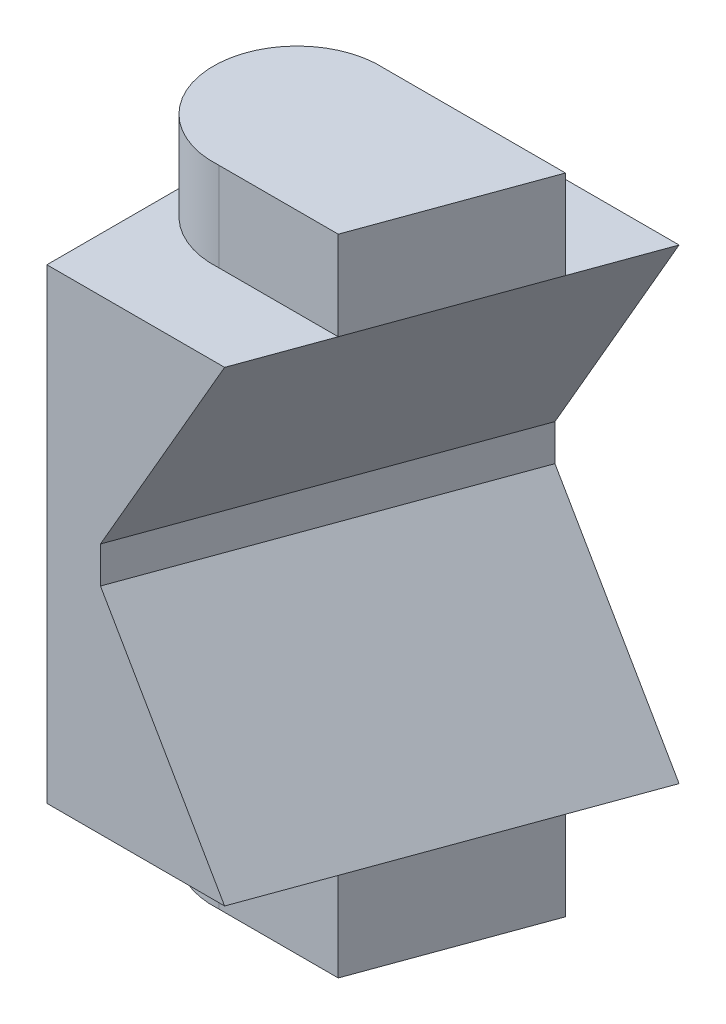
ISO-10303-21;
HEADER;
FILE_DESCRIPTION(('STEP AP214'),'2;1');
FILE_NAME('part.step','',(''),(''),'','','');
FILE_SCHEMA(('AUTOMOTIVE_DESIGN { 1 0 10303 214 1 1 1 1 }'));
ENDSEC;
DATA;
#1=APPLICATION_CONTEXT('core data for automotive mechanical design processes');
#2=APPLICATION_PROTOCOL_DEFINITION('international standard','automotive_design',2000,#1);
#3=PRODUCT_CONTEXT('',#1,'mechanical');
#4=PRODUCT('Part','Part','',(#3));
#5=PRODUCT_RELATED_PRODUCT_CATEGORY('part','',(#4));
#6=PRODUCT_DEFINITION_FORMATION('','',#4);
#7=PRODUCT_DEFINITION_CONTEXT('part definition',#1,'design');
#8=PRODUCT_DEFINITION('design','',#6,#7);
#9=PRODUCT_DEFINITION_SHAPE('','',#8);
#10=(LENGTH_UNIT() NAMED_UNIT(*) SI_UNIT(.MILLI.,.METRE.));
#11=(NAMED_UNIT(*) PLANE_ANGLE_UNIT() SI_UNIT($,.RADIAN.));
#12=(NAMED_UNIT(*) SI_UNIT($,.STERADIAN.) SOLID_ANGLE_UNIT());
#13=UNCERTAINTY_MEASURE_WITH_UNIT(LENGTH_MEASURE(1.E-05),#10,'distance_accuracy_value','');
#14=(GEOMETRIC_REPRESENTATION_CONTEXT(3) GLOBAL_UNCERTAINTY_ASSIGNED_CONTEXT((#13)) GLOBAL_UNIT_ASSIGNED_CONTEXT((#10,
#11,#12)) REPRESENTATION_CONTEXT('',''));
#15=CARTESIAN_POINT('',(0.,0.,0.));
#16=DIRECTION('',(0.,0.,1.));
#17=DIRECTION('',(1.,0.,0.));
#18=AXIS2_PLACEMENT_3D('',#15,#16,#17);
#19=CARTESIAN_POINT('',(0.,10.5,15.));
#20=DIRECTION('',(0.,-1.,0.));
#21=DIRECTION('',(0.,0.,1.));
#22=AXIS2_PLACEMENT_3D('',#19,#20,#21);
#23=PLANE('',#22);
#24=CARTESIAN_POINT('',(3.75781240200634,10.5,7.5));
#25=DIRECTION('',(0.,-1.,0.));
#26=DIRECTION('',(0.,0.,1.));
#27=AXIS2_PLACEMENT_3D('',#24,#25,#26);
#28=CIRCLE('',#27,3.7578125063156);
#29=CARTESIAN_POINT('',(-1.04309262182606E-07,10.5,7.5));
#30=VERTEX_POINT('',#29);
#31=CARTESIAN_POINT('',(4.,10.5,3.75));
#32=VERTEX_POINT('',#31);
#33=EDGE_CURVE('E9',#30,#32,#28,.T.);
#34=ORIENTED_EDGE('',*,*,#33,.T.);
#35=DIRECTION('',(1.,0.,0.));
#36=VECTOR('',#35,1.);
#37=CARTESIAN_POINT('',(4.,10.5,3.75));
#38=LINE('',#37,#36);
#39=CARTESIAN_POINT('',(12.0946651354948,10.5,3.75));
#40=VERTEX_POINT('',#39);
#41=EDGE_CURVE('E141',#32,#40,#38,.T.);
#42=ORIENTED_EDGE('',*,*,#41,.T.);
#43=DIRECTION('',(-0.342020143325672,0.,0.939692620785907));
#44=VECTOR('',#43,1.);
#45=CARTESIAN_POINT('',(13.4595535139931,10.5,0.));
#46=LINE('',#45,#44);
#47=CARTESIAN_POINT('',(13.4595535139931,10.5,0.));
#48=VERTEX_POINT('',#47);
#49=EDGE_CURVE('E204',#48,#40,#46,.T.);
#50=ORIENTED_EDGE('',*,*,#49,.F.);
#51=DIRECTION('',(-1.,0.,0.));
#52=VECTOR('',#51,1.);
#53=CARTESIAN_POINT('',(13.4595535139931,10.5,0.));
#54=LINE('',#53,#52);
#55=CARTESIAN_POINT('',(0.,10.5,0.));
#56=VERTEX_POINT('',#55);
#57=EDGE_CURVE('E208',#48,#56,#54,.T.);
#58=ORIENTED_EDGE('',*,*,#57,.T.);
#59=DIRECTION('',(0.,0.,-1.));
#60=VECTOR('',#59,1.);
#61=CARTESIAN_POINT('',(0.,10.5,15.));
#62=LINE('',#61,#60);
#63=EDGE_CURVE('E199',#30,#56,#62,.T.);
#64=ORIENTED_EDGE('',*,*,#63,.F.);
#65=EDGE_LOOP('',(#34,#42,#50,#58,#64));
#66=FACE_BOUND('',#65,.T.);
#67=ADVANCED_FACE('F14',(#66),#23,.F.);
#68=CARTESIAN_POINT('',(0.,-10.5,15.));
#69=DIRECTION('',(0.,-1.,0.));
#70=DIRECTION('',(0.,0.,1.));
#71=AXIS2_PLACEMENT_3D('',#68,#69,#70);
#72=PLANE('',#71);
#73=DIRECTION('',(-1.,0.,0.));
#74=VECTOR('',#73,1.);
#75=CARTESIAN_POINT('',(4.,-10.5,11.25));
#76=LINE('',#75,#74);
#77=CARTESIAN_POINT('',(9.36488837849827,-10.5,11.25));
#78=VERTEX_POINT('',#77);
#79=CARTESIAN_POINT('',(4.,-10.5,11.25));
#80=VERTEX_POINT('',#79);
#81=EDGE_CURVE('E159',#78,#80,#76,.T.);
#82=ORIENTED_EDGE('',*,*,#81,.F.);
#83=DIRECTION('',(-0.342020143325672,0.,0.939692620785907));
#84=VECTOR('',#83,1.);
#85=CARTESIAN_POINT('',(13.4595535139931,-10.5,0.));
#86=LINE('',#85,#84);
#87=CARTESIAN_POINT('',(8.,-10.5,15.));
#88=VERTEX_POINT('',#87);
#89=EDGE_CURVE('E219',#78,#88,#86,.T.);
#90=ORIENTED_EDGE('',*,*,#89,.T.);
#91=DIRECTION('',(1.,0.,0.));
#92=VECTOR('',#91,1.);
#93=CARTESIAN_POINT('',(0.,-10.5,15.));
#94=LINE('',#93,#92);
#95=CARTESIAN_POINT('',(0.,-10.5,15.));
#96=VERTEX_POINT('',#95);
#97=EDGE_CURVE('E214',#96,#88,#94,.T.);
#98=ORIENTED_EDGE('',*,*,#97,.F.);
#99=DIRECTION('',(0.,0.,-1.));
#100=VECTOR('',#99,1.);
#101=CARTESIAN_POINT('',(0.,-10.5,15.));
#102=LINE('',#101,#100);
#103=CARTESIAN_POINT('',(0.,-10.5,7.5));
#104=VERTEX_POINT('',#103);
#105=EDGE_CURVE('E224',#96,#104,#102,.T.);
#106=ORIENTED_EDGE('',*,*,#105,.T.);
#107=CARTESIAN_POINT('',(3.75781240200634,-10.5,7.5));
#108=DIRECTION('',(0.,-1.,0.));
#109=DIRECTION('',(0.,0.,1.));
#110=AXIS2_PLACEMENT_3D('',#107,#108,#109);
#111=CIRCLE('',#110,3.7578125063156);
#112=EDGE_CURVE('E39',#80,#104,#111,.T.);
#113=ORIENTED_EDGE('',*,*,#112,.F.);
#114=EDGE_LOOP('',(#82,#90,#98,#106,#113));
#115=FACE_BOUND('',#114,.T.);
#116=ADVANCED_FACE('F272',(#115),#72,.T.);
#117=DIRECTION('',(-1.,0.,0.));
#118=VECTOR('',#117,1.);
#119=CARTESIAN_POINT('',(4.,10.5,11.25));
#120=LINE('',#119,#118);
#121=CARTESIAN_POINT('',(9.36488837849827,10.5,11.25));
#122=VERTEX_POINT('',#121);
#123=CARTESIAN_POINT('',(4.,10.5,11.25));
#124=VERTEX_POINT('',#123);
#125=EDGE_CURVE('E150',#122,#124,#120,.T.);
#126=ORIENTED_EDGE('',*,*,#125,.T.);
#127=EDGE_CURVE('E25',#124,#30,#28,.T.);
#128=ORIENTED_EDGE('',*,*,#127,.T.);
#129=CARTESIAN_POINT('',(0.,10.5,15.));
#130=VERTEX_POINT('',#129);
#131=EDGE_CURVE('E211',#130,#30,#62,.T.);
#132=ORIENTED_EDGE('',*,*,#131,.F.);
#133=DIRECTION('',(1.,0.,0.));
#134=VECTOR('',#133,1.);
#135=CARTESIAN_POINT('',(0.,10.5,15.));
#136=LINE('',#135,#134);
#137=CARTESIAN_POINT('',(8.,10.5,15.));
#138=VERTEX_POINT('',#137);
#139=EDGE_CURVE('E200',#130,#138,#136,.T.);
#140=ORIENTED_EDGE('',*,*,#139,.T.);
#141=EDGE_CURVE('E207',#122,#138,#46,.T.);
#142=ORIENTED_EDGE('',*,*,#141,.F.);
#143=EDGE_LOOP('',(#126,#128,#132,#140,#142));
#144=FACE_BOUND('',#143,.T.);
#145=ADVANCED_FACE('F254',(#144),#23,.F.);
#146=CARTESIAN_POINT('',(0.,-10.5,15.));
#147=DIRECTION('',(1.,0.,0.));
#148=DIRECTION('',(0.,0.,1.));
#149=AXIS2_PLACEMENT_3D('',#146,#147,#148);
#150=PLANE('',#149);
#151=DIRECTION('',(0.,1.,0.));
#152=VECTOR('',#151,1.);
#153=CARTESIAN_POINT('',(0.,-10.5,0.));
#154=LINE('',#153,#152);
#155=CARTESIAN_POINT('',(0.,-10.5,0.));
#156=VERTEX_POINT('',#155);
#157=EDGE_CURVE('E227',#156,#56,#154,.T.);
#158=ORIENTED_EDGE('',*,*,#157,.F.);
#159=EDGE_CURVE('E203',#104,#156,#102,.T.);
#160=ORIENTED_EDGE('',*,*,#159,.F.);
#161=ORIENTED_EDGE('',*,*,#105,.F.);
#162=DIRECTION('',(0.,1.,0.));
#163=VECTOR('',#162,1.);
#164=CARTESIAN_POINT('',(0.,-10.5,15.));
#165=LINE('',#164,#163);
#166=EDGE_CURVE('E217',#96,#130,#165,.T.);
#167=ORIENTED_EDGE('',*,*,#166,.T.);
#168=ORIENTED_EDGE('',*,*,#131,.T.);
#169=ORIENTED_EDGE('',*,*,#63,.T.);
#170=EDGE_LOOP('',(#158,#160,#161,#167,#168,#169));
#171=FACE_BOUND('',#170,.T.);
#172=ADVANCED_FACE('F259',(#171),#150,.F.);
#173=CARTESIAN_POINT('',(13.4595535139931,-10.5,0.));
#174=DIRECTION('',(0.,0.,-1.));
#175=DIRECTION('',(1.,0.,0.));
#176=AXIS2_PLACEMENT_3D('',#173,#174,#175);
#177=PLANE('',#176);
#178=DIRECTION('',(-0.5,-0.866025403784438,0.));
#179=VECTOR('',#178,1.);
#180=CARTESIAN_POINT('',(15.8017737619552,14.5568444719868,0.));
#181=LINE('',#180,#179);
#182=CARTESIAN_POINT('',(7.87080290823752,0.82,0.));
#183=VERTEX_POINT('',#182);
#184=EDGE_CURVE('E182',#48,#183,#181,.T.);
#185=ORIENTED_EDGE('',*,*,#184,.T.);
#186=DIRECTION('',(0.,-1.,0.));
#187=VECTOR('',#186,1.);
#188=CARTESIAN_POINT('',(7.87080290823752,0.82,0.));
#189=LINE('',#188,#187);
#190=CARTESIAN_POINT('',(7.87080290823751,-0.82,0.));
#191=VERTEX_POINT('',#190);
#192=EDGE_CURVE('E179',#183,#191,#189,.T.);
#193=ORIENTED_EDGE('',*,*,#192,.T.);
#194=DIRECTION('',(-0.5,0.866025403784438,0.));
#195=VECTOR('',#194,1.);
#196=CARTESIAN_POINT('',(15.8017737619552,-14.5568444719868,0.));
#197=LINE('',#196,#195);
#198=CARTESIAN_POINT('',(13.4595535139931,-10.5,0.));
#199=VERTEX_POINT('',#198);
#200=EDGE_CURVE('E186',#199,#191,#197,.T.);
#201=ORIENTED_EDGE('',*,*,#200,.F.);
#202=DIRECTION('',(-1.,0.,0.));
#203=VECTOR('',#202,1.);
#204=CARTESIAN_POINT('',(13.4595535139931,-10.5,0.));
#205=LINE('',#204,#203);
#206=EDGE_CURVE('E221',#199,#156,#205,.T.);
#207=ORIENTED_EDGE('',*,*,#206,.T.);
#208=ORIENTED_EDGE('',*,*,#157,.T.);
#209=ORIENTED_EDGE('',*,*,#57,.F.);
#210=EDGE_LOOP('',(#185,#193,#201,#207,#208,#209));
#211=FACE_BOUND('',#210,.T.);
#212=ADVANCED_FACE('F16',(#211),#177,.T.);
#213=CARTESIAN_POINT('',(0.,-10.5,15.));
#214=DIRECTION('',(0.,0.,1.));
#215=DIRECTION('',(-1.,0.,0.));
#216=AXIS2_PLACEMENT_3D('',#213,#214,#215);
#217=PLANE('',#216);
#218=DIRECTION('',(-0.5,-0.866025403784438,0.));
#219=VECTOR('',#218,1.);
#220=CARTESIAN_POINT('',(8.,10.5,15.));
#221=LINE('',#220,#219);
#222=CARTESIAN_POINT('',(2.41124939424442,0.82,15.));
#223=VERTEX_POINT('',#222);
#224=EDGE_CURVE('E177',#138,#223,#221,.T.);
#225=ORIENTED_EDGE('',*,*,#224,.F.);
#226=ORIENTED_EDGE('',*,*,#139,.F.);
#227=ORIENTED_EDGE('',*,*,#166,.F.);
#228=ORIENTED_EDGE('',*,*,#97,.T.);
#229=DIRECTION('',(-0.5,0.866025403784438,0.));
#230=VECTOR('',#229,1.);
#231=CARTESIAN_POINT('',(8.,-10.5,15.));
#232=LINE('',#231,#230);
#233=CARTESIAN_POINT('',(2.41124939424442,-0.82,15.));
#234=VERTEX_POINT('',#233);
#235=EDGE_CURVE('E187',#88,#234,#232,.T.);
#236=ORIENTED_EDGE('',*,*,#235,.T.);
#237=DIRECTION('',(0.,-1.,0.));
#238=VECTOR('',#237,1.);
#239=CARTESIAN_POINT('',(2.41124939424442,0.82,15.));
#240=LINE('',#239,#238);
#241=EDGE_CURVE('E191',#223,#234,#240,.T.);
#242=ORIENTED_EDGE('',*,*,#241,.F.);
#243=EDGE_LOOP('',(#225,#226,#227,#228,#236,#242));
#244=FACE_BOUND('',#243,.T.);
#245=ADVANCED_FACE('F264',(#244),#217,.T.);
#246=CARTESIAN_POINT('',(4.,-10.5,3.75));
#247=VERTEX_POINT('',#246);
#248=EDGE_CURVE('E23',#104,#247,#111,.T.);
#249=ORIENTED_EDGE('',*,*,#248,.F.);
#250=ORIENTED_EDGE('',*,*,#159,.T.);
#251=ORIENTED_EDGE('',*,*,#206,.F.);
#252=CARTESIAN_POINT('',(12.0946651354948,-10.5,3.75));
#253=VERTEX_POINT('',#252);
#254=EDGE_CURVE('E218',#199,#253,#86,.T.);
#255=ORIENTED_EDGE('',*,*,#254,.T.);
#256=DIRECTION('',(1.,0.,0.));
#257=VECTOR('',#256,1.);
#258=CARTESIAN_POINT('',(4.,-10.5,3.75));
#259=LINE('',#258,#257);
#260=EDGE_CURVE('E167',#247,#253,#259,.T.);
#261=ORIENTED_EDGE('',*,*,#260,.F.);
#262=EDGE_LOOP('',(#249,#250,#251,#255,#261));
#263=FACE_BOUND('',#262,.T.);
#264=ADVANCED_FACE('F294',(#263),#72,.T.);
#265=CARTESIAN_POINT('',(22.8284345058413,10.5,-25.74078897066));
#266=DIRECTION('',(-0.825964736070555,0.476870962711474,-0.300626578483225));
#267=DIRECTION('',(-0.5,-0.866025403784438,0.));
#268=AXIS2_PLACEMENT_3D('',#265,#266,#267);
#269=PLANE('',#268);
#270=ORIENTED_EDGE('',*,*,#49,.T.);
#271=DIRECTION('',(-0.342020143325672,0.,0.939692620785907));
#272=VECTOR('',#271,1.);
#273=CARTESIAN_POINT('',(12.0946651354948,10.5,3.75));
#274=LINE('',#273,#272);
#275=EDGE_CURVE('E153',#40,#122,#274,.T.);
#276=ORIENTED_EDGE('',*,*,#275,.T.);
#277=ORIENTED_EDGE('',*,*,#141,.T.);
#278=ORIENTED_EDGE('',*,*,#224,.T.);
#279=DIRECTION('',(-0.342020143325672,0.,0.939692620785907));
#280=VECTOR('',#279,1.);
#281=CARTESIAN_POINT('',(17.2396839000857,0.82,-25.74078897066));
#282=LINE('',#281,#280);
#283=EDGE_CURVE('E190',#183,#223,#282,.T.);
#284=ORIENTED_EDGE('',*,*,#283,.F.);
#285=ORIENTED_EDGE('',*,*,#184,.F.);
#286=EDGE_LOOP('',(#270,#276,#277,#278,#284,#285));
#287=FACE_BOUND('',#286,.T.);
#288=ADVANCED_FACE('F241',(#287),#269,.F.);
#289=CARTESIAN_POINT('',(17.2396839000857,0.82,-25.74078897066));
#290=DIRECTION('',(-0.939692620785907,0.,-0.342020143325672));
#291=DIRECTION('',(0.342020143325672,0.,-0.939692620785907));
#292=AXIS2_PLACEMENT_3D('',#289,#290,#291);
#293=PLANE('',#292);
#294=ORIENTED_EDGE('',*,*,#283,.T.);
#295=ORIENTED_EDGE('',*,*,#241,.T.);
#296=DIRECTION('',(-0.342020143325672,0.,0.939692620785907));
#297=VECTOR('',#296,1.);
#298=CARTESIAN_POINT('',(17.2396839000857,-0.82,-25.74078897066));
#299=LINE('',#298,#297);
#300=EDGE_CURVE('E183',#191,#234,#299,.T.);
#301=ORIENTED_EDGE('',*,*,#300,.F.);
#302=ORIENTED_EDGE('',*,*,#192,.F.);
#303=EDGE_LOOP('',(#294,#295,#301,#302));
#304=FACE_BOUND('',#303,.T.);
#305=ADVANCED_FACE('F296',(#304),#293,.F.);
#306=CARTESIAN_POINT('',(22.8284345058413,-10.5,-25.74078897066));
#307=DIRECTION('',(0.825964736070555,0.476870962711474,0.300626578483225));
#308=DIRECTION('',(-0.5,0.866025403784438,0.));
#309=AXIS2_PLACEMENT_3D('',#306,#307,#308);
#310=PLANE('',#309);
#311=ORIENTED_EDGE('',*,*,#200,.T.);
#312=ORIENTED_EDGE('',*,*,#300,.T.);
#313=ORIENTED_EDGE('',*,*,#235,.F.);
#314=ORIENTED_EDGE('',*,*,#89,.F.);
#315=DIRECTION('',(-0.342020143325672,0.,0.939692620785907));
#316=VECTOR('',#315,1.);
#317=CARTESIAN_POINT('',(12.0946651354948,-10.5,3.75));
#318=LINE('',#317,#316);
#319=EDGE_CURVE('E170',#253,#78,#318,.T.);
#320=ORIENTED_EDGE('',*,*,#319,.F.);
#321=ORIENTED_EDGE('',*,*,#254,.F.);
#322=EDGE_LOOP('',(#311,#312,#313,#314,#320,#321));
#323=FACE_BOUND('',#322,.T.);
#324=ADVANCED_FACE('F287',(#323),#310,.T.);
#325=CARTESIAN_POINT('',(3.75781240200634,-14.5,7.5));
#326=DIRECTION('',(0.,1.,0.));
#327=DIRECTION('',(0.,0.,-1.));
#328=AXIS2_PLACEMENT_3D('',#325,#326,#327);
#329=CYLINDRICAL_SURFACE('',#328,3.7578125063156);
#330=ORIENTED_EDGE('',*,*,#112,.T.);
#331=ORIENTED_EDGE('',*,*,#248,.T.);
#332=DIRECTION('',(0.,1.,0.));
#333=VECTOR('',#332,1.);
#334=CARTESIAN_POINT('',(4.,-14.5,3.75));
#335=LINE('',#334,#333);
#336=CARTESIAN_POINT('',(4.,-14.5,3.75));
#337=VERTEX_POINT('',#336);
#338=EDGE_CURVE('E174',#337,#247,#335,.T.);
#339=ORIENTED_EDGE('',*,*,#338,.F.);
#340=CARTESIAN_POINT('',(3.75781240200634,-14.5,7.5));
#341=DIRECTION('',(0.,-1.,0.));
#342=DIRECTION('',(0.,0.,1.));
#343=AXIS2_PLACEMENT_3D('',#340,#341,#342);
#344=CIRCLE('',#343,3.7578125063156);
#345=CARTESIAN_POINT('',(4.,-14.5,11.25));
#346=VERTEX_POINT('',#345);
#347=EDGE_CURVE('E155',#346,#337,#344,.T.);
#348=ORIENTED_EDGE('',*,*,#347,.F.);
#349=DIRECTION('',(0.,1.,0.));
#350=VECTOR('',#349,1.);
#351=CARTESIAN_POINT('',(4.,-14.5,11.25));
#352=LINE('',#351,#350);
#353=EDGE_CURVE('E165',#346,#80,#352,.T.);
#354=ORIENTED_EDGE('',*,*,#353,.T.);
#355=EDGE_LOOP('',(#330,#331,#339,#348,#354));
#356=FACE_BOUND('',#355,.T.);
#357=ADVANCED_FACE('F275',(#356),#329,.T.);
#358=CARTESIAN_POINT('',(4.,-14.5,3.75));
#359=DIRECTION('',(0.,0.,1.));
#360=DIRECTION('',(-1.,0.,0.));
#361=AXIS2_PLACEMENT_3D('',#358,#359,#360);
#362=PLANE('',#361);
#363=ORIENTED_EDGE('',*,*,#260,.T.);
#364=DIRECTION('',(0.,1.,0.));
#365=VECTOR('',#364,1.);
#366=CARTESIAN_POINT('',(12.0946651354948,-14.5,3.75));
#367=LINE('',#366,#365);
#368=CARTESIAN_POINT('',(12.0946651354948,-14.5,3.75));
#369=VERTEX_POINT('',#368);
#370=EDGE_CURVE('E178',#369,#253,#367,.T.);
#371=ORIENTED_EDGE('',*,*,#370,.F.);
#372=DIRECTION('',(1.,0.,0.));
#373=VECTOR('',#372,1.);
#374=CARTESIAN_POINT('',(4.,-14.5,3.75));
#375=LINE('',#374,#373);
#376=EDGE_CURVE('E158',#337,#369,#375,.T.);
#377=ORIENTED_EDGE('',*,*,#376,.F.);
#378=ORIENTED_EDGE('',*,*,#338,.T.);
#379=EDGE_LOOP('',(#363,#371,#377,#378));
#380=FACE_BOUND('',#379,.T.);
#381=ADVANCED_FACE('F293',(#380),#362,.F.);
#382=CARTESIAN_POINT('',(12.0946651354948,-14.5,3.75));
#383=DIRECTION('',(-0.939692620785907,0.,-0.342020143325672));
#384=DIRECTION('',(0.342020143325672,0.,-0.939692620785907));
#385=AXIS2_PLACEMENT_3D('',#382,#383,#384);
#386=PLANE('',#385);
#387=ORIENTED_EDGE('',*,*,#319,.T.);
#388=DIRECTION('',(0.,1.,0.));
#389=VECTOR('',#388,1.);
#390=CARTESIAN_POINT('',(9.36488837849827,-14.5,11.25));
#391=LINE('',#390,#389);
#392=CARTESIAN_POINT('',(9.36488837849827,-14.5,11.25));
#393=VERTEX_POINT('',#392);
#394=EDGE_CURVE('E173',#393,#78,#391,.T.);
#395=ORIENTED_EDGE('',*,*,#394,.F.);
#396=DIRECTION('',(-0.342020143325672,0.,0.939692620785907));
#397=VECTOR('',#396,1.);
#398=CARTESIAN_POINT('',(12.0946651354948,-14.5,3.75));
#399=LINE('',#398,#397);
#400=EDGE_CURVE('E161',#369,#393,#399,.T.);
#401=ORIENTED_EDGE('',*,*,#400,.F.);
#402=ORIENTED_EDGE('',*,*,#370,.T.);
#403=EDGE_LOOP('',(#387,#395,#401,#402));
#404=FACE_BOUND('',#403,.T.);
#405=ADVANCED_FACE('F289',(#404),#386,.F.);
#406=CARTESIAN_POINT('',(4.,-14.5,11.25));
#407=DIRECTION('',(0.,0.,-1.));
#408=DIRECTION('',(1.,0.,0.));
#409=AXIS2_PLACEMENT_3D('',#406,#407,#408);
#410=PLANE('',#409);
#411=ORIENTED_EDGE('',*,*,#81,.T.);
#412=ORIENTED_EDGE('',*,*,#353,.F.);
#413=DIRECTION('',(-1.,0.,0.));
#414=VECTOR('',#413,1.);
#415=CARTESIAN_POINT('',(4.,-14.5,11.25));
#416=LINE('',#415,#414);
#417=EDGE_CURVE('E163',#393,#346,#416,.T.);
#418=ORIENTED_EDGE('',*,*,#417,.F.);
#419=ORIENTED_EDGE('',*,*,#394,.T.);
#420=EDGE_LOOP('',(#411,#412,#418,#419));
#421=FACE_BOUND('',#420,.T.);
#422=ADVANCED_FACE('F281',(#421),#410,.F.);
#423=CARTESIAN_POINT('',(3.75781240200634,-14.5,7.5));
#424=DIRECTION('',(0.,-1.,0.));
#425=DIRECTION('',(0.,0.,1.));
#426=AXIS2_PLACEMENT_3D('',#423,#424,#425);
#427=PLANE('',#426);
#428=ORIENTED_EDGE('',*,*,#347,.T.);
#429=ORIENTED_EDGE('',*,*,#376,.T.);
#430=ORIENTED_EDGE('',*,*,#400,.T.);
#431=ORIENTED_EDGE('',*,*,#417,.T.);
#432=EDGE_LOOP('',(#428,#429,#430,#431));
#433=FACE_BOUND('',#432,.T.);
#434=ADVANCED_FACE('F407',(#433),#427,.T.);
#435=CARTESIAN_POINT('',(3.75781240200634,14.5,7.5));
#436=DIRECTION('',(0.,-1.,0.));
#437=DIRECTION('',(0.,0.,1.));
#438=AXIS2_PLACEMENT_3D('',#435,#436,#437);
#439=CYLINDRICAL_SURFACE('',#438,3.7578125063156);
#440=ORIENTED_EDGE('',*,*,#127,.F.);
#441=DIRECTION('',(0.,-1.,0.));
#442=VECTOR('',#441,1.);
#443=CARTESIAN_POINT('',(4.,14.5,11.25));
#444=LINE('',#443,#442);
#445=CARTESIAN_POINT('',(4.,14.5,11.25));
#446=VERTEX_POINT('',#445);
#447=EDGE_CURVE('E122',#446,#124,#444,.T.);
#448=ORIENTED_EDGE('',*,*,#447,.F.);
#449=CARTESIAN_POINT('',(3.75781240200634,14.5,7.5));
#450=DIRECTION('',(0.,-1.,0.));
#451=DIRECTION('',(0.,0.,1.));
#452=AXIS2_PLACEMENT_3D('',#449,#450,#451);
#453=CIRCLE('',#452,3.7578125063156);
#454=CARTESIAN_POINT('',(4.,14.5,3.75));
#455=VERTEX_POINT('',#454);
#456=EDGE_CURVE('E125',#446,#455,#453,.T.);
#457=ORIENTED_EDGE('',*,*,#456,.T.);
#458=DIRECTION('',(0.,-1.,0.));
#459=VECTOR('',#458,1.);
#460=CARTESIAN_POINT('',(4.,14.5,3.75));
#461=LINE('',#460,#459);
#462=EDGE_CURVE('E148',#455,#32,#461,.T.);
#463=ORIENTED_EDGE('',*,*,#462,.T.);
#464=ORIENTED_EDGE('',*,*,#33,.F.);
#465=EDGE_LOOP('',(#440,#448,#457,#463,#464));
#466=FACE_BOUND('',#465,.T.);
#467=ADVANCED_FACE('F124',(#466),#439,.T.);
#468=CARTESIAN_POINT('',(4.,14.5,11.25));
#469=DIRECTION('',(0.,0.,1.));
#470=DIRECTION('',(-1.,0.,0.));
#471=AXIS2_PLACEMENT_3D('',#468,#469,#470);
#472=PLANE('',#471);
#473=ORIENTED_EDGE('',*,*,#125,.F.);
#474=DIRECTION('',(0.,-1.,0.));
#475=VECTOR('',#474,1.);
#476=CARTESIAN_POINT('',(9.36488837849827,14.5,11.25));
#477=LINE('',#476,#475);
#478=CARTESIAN_POINT('',(9.36488837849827,14.5,11.25));
#479=VERTEX_POINT('',#478);
#480=EDGE_CURVE('E131',#479,#122,#477,.T.);
#481=ORIENTED_EDGE('',*,*,#480,.F.);
#482=DIRECTION('',(-1.,0.,0.));
#483=VECTOR('',#482,1.);
#484=CARTESIAN_POINT('',(4.,14.5,11.25));
#485=LINE('',#484,#483);
#486=EDGE_CURVE('E137',#479,#446,#485,.T.);
#487=ORIENTED_EDGE('',*,*,#486,.T.);
#488=ORIENTED_EDGE('',*,*,#447,.T.);
#489=EDGE_LOOP('',(#473,#481,#487,#488));
#490=FACE_BOUND('',#489,.T.);
#491=ADVANCED_FACE('F143',(#490),#472,.T.);
#492=CARTESIAN_POINT('',(12.0946651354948,14.5,3.75));
#493=DIRECTION('',(0.939692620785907,0.,0.342020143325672));
#494=DIRECTION('',(-0.342020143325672,0.,0.939692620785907));
#495=AXIS2_PLACEMENT_3D('',#492,#493,#494);
#496=PLANE('',#495);
#497=ORIENTED_EDGE('',*,*,#275,.F.);
#498=DIRECTION('',(0.,-1.,0.));
#499=VECTOR('',#498,1.);
#500=CARTESIAN_POINT('',(12.0946651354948,14.5,3.75));
#501=LINE('',#500,#499);
#502=CARTESIAN_POINT('',(12.0946651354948,14.5,3.75));
#503=VERTEX_POINT('',#502);
#504=EDGE_CURVE('E18',#503,#40,#501,.T.);
#505=ORIENTED_EDGE('',*,*,#504,.F.);
#506=DIRECTION('',(-0.342020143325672,0.,0.939692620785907));
#507=VECTOR('',#506,1.);
#508=CARTESIAN_POINT('',(12.0946651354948,14.5,3.75));
#509=LINE('',#508,#507);
#510=EDGE_CURVE('E144',#503,#479,#509,.T.);
#511=ORIENTED_EDGE('',*,*,#510,.T.);
#512=ORIENTED_EDGE('',*,*,#480,.T.);
#513=EDGE_LOOP('',(#497,#505,#511,#512));
#514=FACE_BOUND('',#513,.T.);
#515=ADVANCED_FACE('F246',(#514),#496,.T.);
#516=CARTESIAN_POINT('',(4.,14.5,3.75));
#517=DIRECTION('',(0.,0.,-1.));
#518=DIRECTION('',(1.,0.,0.));
#519=AXIS2_PLACEMENT_3D('',#516,#517,#518);
#520=PLANE('',#519);
#521=ORIENTED_EDGE('',*,*,#41,.F.);
#522=ORIENTED_EDGE('',*,*,#462,.F.);
#523=DIRECTION('',(1.,0.,0.));
#524=VECTOR('',#523,1.);
#525=CARTESIAN_POINT('',(4.,14.5,3.75));
#526=LINE('',#525,#524);
#527=EDGE_CURVE('E140',#455,#503,#526,.T.);
#528=ORIENTED_EDGE('',*,*,#527,.T.);
#529=ORIENTED_EDGE('',*,*,#504,.T.);
#530=EDGE_LOOP('',(#521,#522,#528,#529));
#531=FACE_BOUND('',#530,.T.);
#532=ADVANCED_FACE('F251',(#531),#520,.T.);
#533=CARTESIAN_POINT('',(3.75781240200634,14.5,7.5));
#534=DIRECTION('',(0.,1.,0.));
#535=DIRECTION('',(0.,0.,1.));
#536=AXIS2_PLACEMENT_3D('',#533,#534,#535);
#537=PLANE('',#536);
#538=ORIENTED_EDGE('',*,*,#456,.F.);
#539=ORIENTED_EDGE('',*,*,#486,.F.);
#540=ORIENTED_EDGE('',*,*,#510,.F.);
#541=ORIENTED_EDGE('',*,*,#527,.F.);
#542=EDGE_LOOP('',(#538,#539,#540,#541));
#543=FACE_BOUND('',#542,.T.);
#544=ADVANCED_FACE('F135',(#543),#537,.T.);
#545=CLOSED_SHELL('',(#67,#116,#145,#172,#212,#245,#264,#288,#305,#324,#357,#381,#405,#422,#434,
#467,#491,#515,#532,#544));
#546=MANIFOLD_SOLID_BREP('B1',#545);
#547=ADVANCED_BREP_SHAPE_REPRESENTATION('',(#18,#546),#14);
#548=SHAPE_DEFINITION_REPRESENTATION(#9,#547);
ENDSEC;
END-ISO-10303-21;
